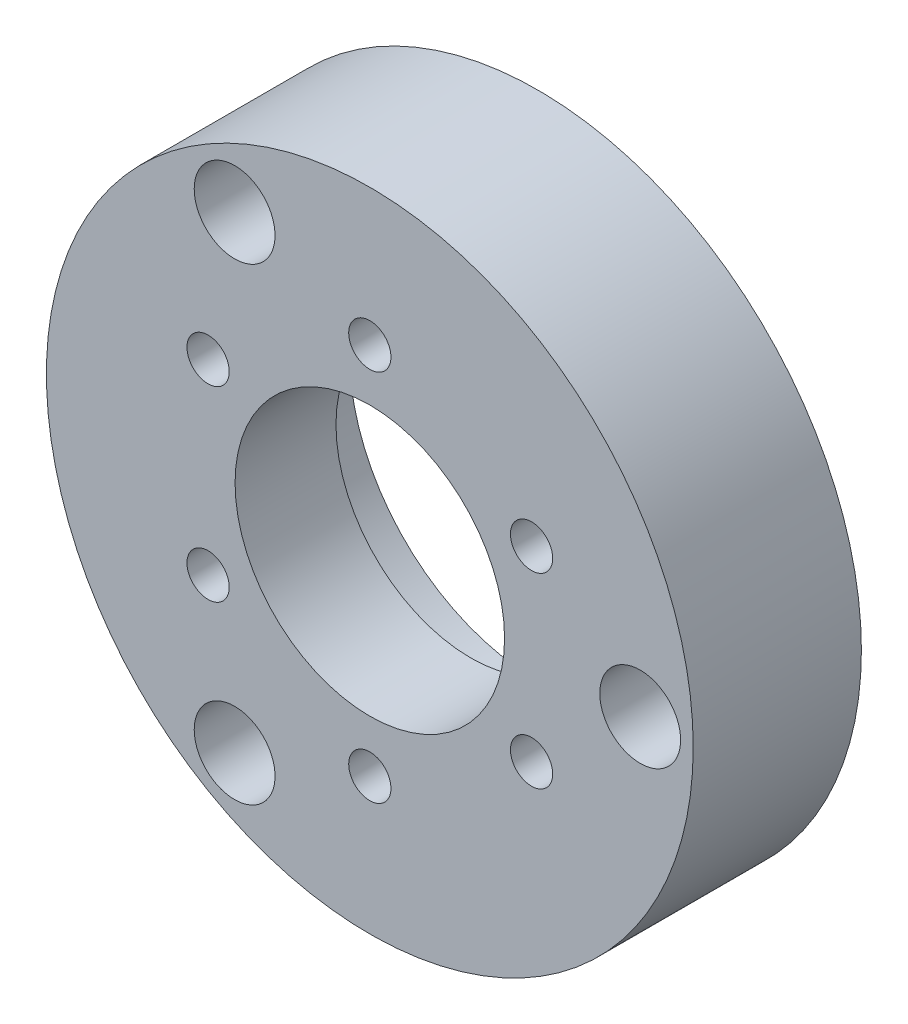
ISO-10303-21;
HEADER;
FILE_DESCRIPTION(('STEP AP214'),'2;1');
FILE_NAME('part.step','',(''),(''),'','','');
FILE_SCHEMA(('AUTOMOTIVE_DESIGN { 1 0 10303 214 1 1 1 1 }'));
ENDSEC;
DATA;
#1=APPLICATION_CONTEXT('core data for automotive mechanical design processes');
#2=APPLICATION_PROTOCOL_DEFINITION('international standard','automotive_design',2000,#1);
#3=PRODUCT_CONTEXT('',#1,'mechanical');
#4=PRODUCT('Part','Part','',(#3));
#5=PRODUCT_RELATED_PRODUCT_CATEGORY('part','',(#4));
#6=PRODUCT_DEFINITION_FORMATION('','',#4);
#7=PRODUCT_DEFINITION_CONTEXT('part definition',#1,'design');
#8=PRODUCT_DEFINITION('design','',#6,#7);
#9=PRODUCT_DEFINITION_SHAPE('','',#8);
#10=(LENGTH_UNIT() NAMED_UNIT(*) SI_UNIT(.MILLI.,.METRE.));
#11=(NAMED_UNIT(*) PLANE_ANGLE_UNIT() SI_UNIT($,.RADIAN.));
#12=(NAMED_UNIT(*) SI_UNIT($,.STERADIAN.) SOLID_ANGLE_UNIT());
#13=UNCERTAINTY_MEASURE_WITH_UNIT(LENGTH_MEASURE(1.E-05),#10,'distance_accuracy_value','');
#14=(GEOMETRIC_REPRESENTATION_CONTEXT(3) GLOBAL_UNCERTAINTY_ASSIGNED_CONTEXT((#13)) GLOBAL_UNIT_ASSIGNED_CONTEXT((#10,
#11,#12)) REPRESENTATION_CONTEXT('',''));
#15=CARTESIAN_POINT('',(0.,0.,0.));
#16=DIRECTION('',(0.,0.,1.));
#17=DIRECTION('',(1.,0.,0.));
#18=AXIS2_PLACEMENT_3D('',#15,#16,#17);
#19=CARTESIAN_POINT('',(0.,15.875,19.812));
#20=DIRECTION('',(0.,0.,-1.));
#21=DIRECTION('',(-1.,0.,0.));
#22=AXIS2_PLACEMENT_3D('',#19,#20,#21);
#23=PLANE('',#22);
#24=CARTESIAN_POINT('',(-15.9257999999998,-27.5842947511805,19.812));
#25=DIRECTION('',(0.,0.,-1.));
#26=DIRECTION('',(-1.,0.,0.));
#27=AXIS2_PLACEMENT_3D('',#24,#25,#26);
#28=CIRCLE('',#27,4.7625);
#29=CARTESIAN_POINT('',(-20.6882999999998,-27.5842947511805,19.812));
#30=VERTEX_POINT('',#29);
#31=EDGE_CURVE('E248',#30,#30,#28,.F.);
#32=ORIENTED_EDGE('',*,*,#31,.F.);
#33=EDGE_LOOP('',(#32));
#34=FACE_BOUND('',#33,.T.);
#35=CARTESIAN_POINT('',(19.0525588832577,-10.9999999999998,19.812));
#36=DIRECTION('',(0.,0.,-1.));
#37=DIRECTION('',(-1.,0.,0.));
#38=AXIS2_PLACEMENT_3D('',#35,#36,#37);
#39=CIRCLE('',#38,2.4892);
#40=CARTESIAN_POINT('',(16.5633588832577,-10.9999999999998,19.812));
#41=VERTEX_POINT('',#40);
#42=EDGE_CURVE('E149',#41,#41,#39,.F.);
#43=ORIENTED_EDGE('',*,*,#42,.F.);
#44=EDGE_LOOP('',(#43));
#45=FACE_BOUND('',#44,.T.);
#46=CARTESIAN_POINT('',(-19.0525588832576,-11.0000000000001,19.812));
#47=DIRECTION('',(0.,0.,-1.));
#48=DIRECTION('',(-1.,0.,0.));
#49=AXIS2_PLACEMENT_3D('',#46,#47,#48);
#50=CIRCLE('',#49,2.4892);
#51=CARTESIAN_POINT('',(-21.5417588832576,-11.0000000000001,19.812));
#52=VERTEX_POINT('',#51);
#53=EDGE_CURVE('E168',#52,#52,#50,.F.);
#54=ORIENTED_EDGE('',*,*,#53,.F.);
#55=EDGE_LOOP('',(#54));
#56=FACE_BOUND('',#55,.T.);
#57=CARTESIAN_POINT('',(0.,22.,19.812));
#58=DIRECTION('',(0.,0.,-1.));
#59=DIRECTION('',(-1.,0.,0.));
#60=AXIS2_PLACEMENT_3D('',#57,#58,#59);
#61=CIRCLE('',#60,2.4892);
#62=CARTESIAN_POINT('',(-2.4892,22.,19.812));
#63=VERTEX_POINT('',#62);
#64=EDGE_CURVE('E188',#63,#63,#61,.F.);
#65=ORIENTED_EDGE('',*,*,#64,.F.);
#66=EDGE_LOOP('',(#65));
#67=FACE_BOUND('',#66,.T.);
#68=CARTESIAN_POINT('',(0.,0.,19.812));
#69=DIRECTION('',(0.,0.,1.));
#70=DIRECTION('',(1.,0.,0.));
#71=AXIS2_PLACEMENT_3D('',#68,#69,#70);
#72=CIRCLE('',#71,15.875);
#73=CARTESIAN_POINT('',(15.875,0.,19.812));
#74=VERTEX_POINT('',#73);
#75=EDGE_CURVE('E202',#74,#74,#72,.T.);
#76=ORIENTED_EDGE('',*,*,#75,.F.);
#77=EDGE_LOOP('',(#76));
#78=FACE_BOUND('',#77,.T.);
#79=CARTESIAN_POINT('',(0.,0.,19.812));
#80=DIRECTION('',(0.,0.,1.));
#81=DIRECTION('',(1.,0.,0.));
#82=AXIS2_PLACEMENT_3D('',#79,#80,#81);
#83=CIRCLE('',#82,38.1);
#84=CARTESIAN_POINT('',(38.1,0.,19.812));
#85=VERTEX_POINT('',#84);
#86=EDGE_CURVE('E199',#85,#85,#83,.T.);
#87=ORIENTED_EDGE('',*,*,#86,.T.);
#88=EDGE_LOOP('',(#87));
#89=FACE_BOUND('',#88,.T.);
#90=CARTESIAN_POINT('',(-19.0525588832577,11.,19.812));
#91=DIRECTION('',(0.,0.,-1.));
#92=DIRECTION('',(-1.,0.,0.));
#93=AXIS2_PLACEMENT_3D('',#90,#91,#92);
#94=CIRCLE('',#93,2.4892);
#95=CARTESIAN_POINT('',(-21.5417588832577,11.,19.812));
#96=VERTEX_POINT('',#95);
#97=EDGE_CURVE('E178',#96,#96,#94,.F.);
#98=ORIENTED_EDGE('',*,*,#97,.F.);
#99=EDGE_LOOP('',(#98));
#100=FACE_BOUND('',#99,.T.);
#101=CARTESIAN_POINT('',(0.,-22.,19.812));
#102=DIRECTION('',(0.,0.,-1.));
#103=DIRECTION('',(-1.,0.,0.));
#104=AXIS2_PLACEMENT_3D('',#101,#102,#103);
#105=CIRCLE('',#104,2.4892);
#106=CARTESIAN_POINT('',(-2.4892,-22.,19.812));
#107=VERTEX_POINT('',#106);
#108=EDGE_CURVE('E158',#107,#107,#105,.F.);
#109=ORIENTED_EDGE('',*,*,#108,.F.);
#110=EDGE_LOOP('',(#109));
#111=FACE_BOUND('',#110,.T.);
#112=CARTESIAN_POINT('',(19.0525588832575,11.0000000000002,19.812));
#113=DIRECTION('',(0.,0.,-1.));
#114=DIRECTION('',(-1.,0.,0.));
#115=AXIS2_PLACEMENT_3D('',#112,#113,#114);
#116=CIRCLE('',#115,2.4892);
#117=CARTESIAN_POINT('',(16.5633588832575,11.0000000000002,19.812));
#118=VERTEX_POINT('',#117);
#119=EDGE_CURVE('E133',#118,#118,#116,.F.);
#120=ORIENTED_EDGE('',*,*,#119,.F.);
#121=EDGE_LOOP('',(#120));
#122=FACE_BOUND('',#121,.T.);
#123=CARTESIAN_POINT('',(-15.9258,27.5842947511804,19.812));
#124=DIRECTION('',(0.,0.,-1.));
#125=DIRECTION('',(-1.,0.,0.));
#126=AXIS2_PLACEMENT_3D('',#123,#124,#125);
#127=CIRCLE('',#126,4.7625);
#128=CARTESIAN_POINT('',(-20.6883,27.5842947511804,19.812));
#129=VERTEX_POINT('',#128);
#130=EDGE_CURVE('E240',#129,#129,#127,.F.);
#131=ORIENTED_EDGE('',*,*,#130,.F.);
#132=EDGE_LOOP('',(#131));
#133=FACE_BOUND('',#132,.T.);
#134=CARTESIAN_POINT('',(31.8516,-1.00782782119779E-13,19.812));
#135=DIRECTION('',(0.,0.,-1.));
#136=DIRECTION('',(-1.,0.,0.));
#137=AXIS2_PLACEMENT_3D('',#134,#135,#136);
#138=CIRCLE('',#137,4.7625);
#139=CARTESIAN_POINT('',(27.0891,-1.00782782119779E-13,19.812));
#140=VERTEX_POINT('',#139);
#141=EDGE_CURVE('E39',#140,#140,#138,.F.);
#142=ORIENTED_EDGE('',*,*,#141,.F.);
#143=EDGE_LOOP('',(#142));
#144=FACE_BOUND('',#143,.T.);
#145=ADVANCED_FACE('F35',(#34,#45,#56,#67,#78,#89,#100,#111,#122,#133,#144),#23,.F.);
#146=CARTESIAN_POINT('',(31.8516,-1.00782782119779E-13,50.8));
#147=DIRECTION('',(0.,0.,-1.));
#148=DIRECTION('',(-1.,0.,0.));
#149=AXIS2_PLACEMENT_3D('',#146,#147,#148);
#150=CYLINDRICAL_SURFACE('',#149,3.175);
#151=CARTESIAN_POINT('',(31.8516,-1.00782782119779E-13,0.));
#152=DIRECTION('',(0.,0.,1.));
#153=DIRECTION('',(1.,0.,0.));
#154=AXIS2_PLACEMENT_3D('',#151,#152,#153);
#155=CIRCLE('',#154,3.175);
#156=CARTESIAN_POINT('',(35.0266,-1.00782782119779E-13,0.));
#157=VERTEX_POINT('',#156);
#158=EDGE_CURVE('E268',#157,#157,#155,.T.);
#159=ORIENTED_EDGE('',*,*,#158,.F.);
#160=EDGE_LOOP('',(#159));
#161=FACE_BOUND('',#160,.T.);
#162=CARTESIAN_POINT('',(31.8516,-1.00782782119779E-13,6.35));
#163=DIRECTION('',(0.,0.,1.));
#164=DIRECTION('',(1.,0.,0.));
#165=AXIS2_PLACEMENT_3D('',#162,#163,#164);
#166=CIRCLE('',#165,3.175);
#167=CARTESIAN_POINT('',(35.0266,-1.00782782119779E-13,6.35));
#168=VERTEX_POINT('',#167);
#169=EDGE_CURVE('E251',#168,#168,#166,.T.);
#170=ORIENTED_EDGE('',*,*,#169,.T.);
#171=EDGE_LOOP('',(#170));
#172=FACE_BOUND('',#171,.T.);
#173=ADVANCED_FACE('F280',(#161,#172),#150,.F.);
#174=CARTESIAN_POINT('',(-15.9257999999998,-27.5842947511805,50.8));
#175=DIRECTION('',(0.,0.,-1.));
#176=DIRECTION('',(-1.,0.,0.));
#177=AXIS2_PLACEMENT_3D('',#174,#175,#176);
#178=CYLINDRICAL_SURFACE('',#177,3.175);
#179=CARTESIAN_POINT('',(-15.9257999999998,-27.5842947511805,0.));
#180=DIRECTION('',(0.,0.,1.));
#181=DIRECTION('',(1.,0.,0.));
#182=AXIS2_PLACEMENT_3D('',#179,#180,#181);
#183=CIRCLE('',#182,3.175);
#184=CARTESIAN_POINT('',(-12.7507999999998,-27.5842947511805,0.));
#185=VERTEX_POINT('',#184);
#186=EDGE_CURVE('E134',#185,#185,#183,.T.);
#187=ORIENTED_EDGE('',*,*,#186,.F.);
#188=EDGE_LOOP('',(#187));
#189=FACE_BOUND('',#188,.T.);
#190=CARTESIAN_POINT('',(-15.9257999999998,-27.5842947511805,6.35));
#191=DIRECTION('',(0.,0.,1.));
#192=DIRECTION('',(1.,0.,0.));
#193=AXIS2_PLACEMENT_3D('',#190,#191,#192);
#194=CIRCLE('',#193,3.175);
#195=CARTESIAN_POINT('',(-12.7507999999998,-27.5842947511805,6.35));
#196=VERTEX_POINT('',#195);
#197=EDGE_CURVE('E245',#196,#196,#194,.T.);
#198=ORIENTED_EDGE('',*,*,#197,.T.);
#199=EDGE_LOOP('',(#198));
#200=FACE_BOUND('',#199,.T.);
#201=ADVANCED_FACE('F276',(#189,#200),#178,.F.);
#202=CARTESIAN_POINT('',(-15.9258,27.5842947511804,50.8));
#203=DIRECTION('',(0.,0.,-1.));
#204=DIRECTION('',(-1.,0.,0.));
#205=AXIS2_PLACEMENT_3D('',#202,#203,#204);
#206=CYLINDRICAL_SURFACE('',#205,3.175);
#207=CARTESIAN_POINT('',(-15.9258,27.5842947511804,0.));
#208=DIRECTION('',(0.,0.,1.));
#209=DIRECTION('',(1.,0.,0.));
#210=AXIS2_PLACEMENT_3D('',#207,#208,#209);
#211=CIRCLE('',#210,3.175);
#212=CARTESIAN_POINT('',(-12.7508,27.5842947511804,0.));
#213=VERTEX_POINT('',#212);
#214=EDGE_CURVE('E244',#213,#213,#211,.T.);
#215=ORIENTED_EDGE('',*,*,#214,.F.);
#216=EDGE_LOOP('',(#215));
#217=FACE_BOUND('',#216,.T.);
#218=CARTESIAN_POINT('',(-15.9258,27.5842947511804,6.35));
#219=DIRECTION('',(0.,0.,1.));
#220=DIRECTION('',(1.,0.,0.));
#221=AXIS2_PLACEMENT_3D('',#218,#219,#220);
#222=CIRCLE('',#221,3.175);
#223=CARTESIAN_POINT('',(-12.7508,27.5842947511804,6.35));
#224=VERTEX_POINT('',#223);
#225=EDGE_CURVE('E237',#224,#224,#222,.T.);
#226=ORIENTED_EDGE('',*,*,#225,.T.);
#227=EDGE_LOOP('',(#226));
#228=FACE_BOUND('',#227,.T.);
#229=ADVANCED_FACE('F279',(#217,#228),#206,.F.);
#230=CARTESIAN_POINT('',(0.,38.1,0.));
#231=DIRECTION('',(0.,0.,1.));
#232=DIRECTION('',(1.,0.,0.));
#233=AXIS2_PLACEMENT_3D('',#230,#231,#232);
#234=PLANE('',#233);
#235=ORIENTED_EDGE('',*,*,#158,.T.);
#236=EDGE_LOOP('',(#235));
#237=FACE_BOUND('',#236,.T.);
#238=CARTESIAN_POINT('',(0.,0.,0.));
#239=DIRECTION('',(0.,0.,1.));
#240=DIRECTION('',(1.,0.,0.));
#241=AXIS2_PLACEMENT_3D('',#238,#239,#240);
#242=CIRCLE('',#241,22.1996);
#243=CARTESIAN_POINT('',(22.1996,0.,0.));
#244=VERTEX_POINT('',#243);
#245=EDGE_CURVE('E212',#244,#244,#242,.T.);
#246=ORIENTED_EDGE('',*,*,#245,.T.);
#247=EDGE_LOOP('',(#246));
#248=FACE_BOUND('',#247,.T.);
#249=CARTESIAN_POINT('',(0.,0.,0.));
#250=DIRECTION('',(0.,0.,1.));
#251=DIRECTION('',(1.,0.,0.));
#252=AXIS2_PLACEMENT_3D('',#249,#250,#251);
#253=CIRCLE('',#252,38.1);
#254=CARTESIAN_POINT('',(38.1,0.,0.));
#255=VERTEX_POINT('',#254);
#256=EDGE_CURVE('E196',#255,#255,#253,.T.);
#257=ORIENTED_EDGE('',*,*,#256,.F.);
#258=EDGE_LOOP('',(#257));
#259=FACE_BOUND('',#258,.T.);
#260=ORIENTED_EDGE('',*,*,#186,.T.);
#261=EDGE_LOOP('',(#260));
#262=FACE_BOUND('',#261,.T.);
#263=ORIENTED_EDGE('',*,*,#214,.T.);
#264=EDGE_LOOP('',(#263));
#265=FACE_BOUND('',#264,.T.);
#266=ADVANCED_FACE('F37',(#237,#248,#259,#262,#265),#234,.F.);
#267=CARTESIAN_POINT('',(0.,0.,0.));
#268=DIRECTION('',(0.,0.,1.));
#269=DIRECTION('',(1.,0.,0.));
#270=AXIS2_PLACEMENT_3D('',#267,#268,#269);
#271=CYLINDRICAL_SURFACE('',#270,22.1996);
#272=ORIENTED_EDGE('',*,*,#245,.F.);
#273=EDGE_LOOP('',(#272));
#274=FACE_BOUND('',#273,.T.);
#275=DIRECTION('',(0.,0.,-1.));
#276=VECTOR('',#275,1.);
#277=CARTESIAN_POINT('',(17.8600051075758,13.184932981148,19.05));
#278=LINE('',#277,#276);
#279=CARTESIAN_POINT('',(17.8600051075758,13.184932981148,7.9248));
#280=VERTEX_POINT('',#279);
#281=CARTESIAN_POINT('',(17.8600051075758,13.184932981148,6.35));
#282=VERTEX_POINT('',#281);
#283=EDGE_CURVE('E132',#280,#282,#278,.T.);
#284=ORIENTED_EDGE('',*,*,#283,.F.);
#285=CARTESIAN_POINT('',(0.,0.,7.9248));
#286=DIRECTION('',(0.,0.,1.));
#287=DIRECTION('',(1.,0.,0.));
#288=AXIS2_PLACEMENT_3D('',#285,#286,#287);
#289=CIRCLE('',#288,22.1996);
#290=CARTESIAN_POINT('',(2.4884843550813,22.0596846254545,7.9248));
#291=VERTEX_POINT('',#290);
#292=EDGE_CURVE('E208',#280,#291,#289,.T.);
#293=ORIENTED_EDGE('',*,*,#292,.T.);
#294=DIRECTION('',(0.,0.,-1.));
#295=VECTOR('',#294,1.);
#296=CARTESIAN_POINT('',(2.48848435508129,22.0596846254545,19.05));
#297=LINE('',#296,#295);
#298=CARTESIAN_POINT('',(2.48848435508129,22.0596846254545,6.35));
#299=VERTEX_POINT('',#298);
#300=EDGE_CURVE('E191',#299,#291,#297,.F.);
#301=ORIENTED_EDGE('',*,*,#300,.F.);
#302=CARTESIAN_POINT('',(0.,0.,6.35));
#303=DIRECTION('',(0.,0.,1.));
#304=DIRECTION('',(1.,0.,0.));
#305=AXIS2_PLACEMENT_3D('',#302,#303,#304);
#306=CIRCLE('',#305,22.1996);
#307=CARTESIAN_POINT('',(-2.48848435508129,22.0596846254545,6.35));
#308=VERTEX_POINT('',#307);
#309=EDGE_CURVE('E216',#308,#299,#306,.F.);
#310=ORIENTED_EDGE('',*,*,#309,.F.);
#311=DIRECTION('',(0.,0.,-1.));
#312=VECTOR('',#311,1.);
#313=CARTESIAN_POINT('',(-2.48848435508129,22.0596846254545,19.05));
#314=LINE('',#313,#312);
#315=CARTESIAN_POINT('',(-2.4884843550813,22.0596846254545,7.9248));
#316=VERTEX_POINT('',#315);
#317=EDGE_CURVE('E194',#316,#308,#314,.T.);
#318=ORIENTED_EDGE('',*,*,#317,.F.);
#319=CARTESIAN_POINT('',(-17.860005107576,13.1849329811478,7.9248));
#320=VERTEX_POINT('',#319);
#321=EDGE_CURVE('E209',#316,#320,#289,.T.);
#322=ORIENTED_EDGE('',*,*,#321,.T.);
#323=DIRECTION('',(0.,0.,-1.));
#324=VECTOR('',#323,1.);
#325=CARTESIAN_POINT('',(-17.860005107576,13.1849329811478,19.05));
#326=LINE('',#325,#324);
#327=CARTESIAN_POINT('',(-17.860005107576,13.1849329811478,6.35));
#328=VERTEX_POINT('',#327);
#329=EDGE_CURVE('E181',#328,#320,#326,.F.);
#330=ORIENTED_EDGE('',*,*,#329,.F.);
#331=CARTESIAN_POINT('',(0.,0.,6.35));
#332=DIRECTION('',(0.,0.,1.));
#333=DIRECTION('',(1.,0.,0.));
#334=AXIS2_PLACEMENT_3D('',#331,#332,#333);
#335=CIRCLE('',#334,22.1996);
#336=CARTESIAN_POINT('',(-20.3484894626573,8.87475164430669,6.35));
#337=VERTEX_POINT('',#336);
#338=EDGE_CURVE('E220',#337,#328,#335,.F.);
#339=ORIENTED_EDGE('',*,*,#338,.F.);
#340=DIRECTION('',(0.,0.,-1.));
#341=VECTOR('',#340,1.);
#342=CARTESIAN_POINT('',(-20.3484894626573,8.87475164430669,19.05));
#343=LINE('',#342,#341);
#344=CARTESIAN_POINT('',(-20.3484894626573,8.87475164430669,7.9248));
#345=VERTEX_POINT('',#344);
#346=EDGE_CURVE('E183',#345,#337,#343,.T.);
#347=ORIENTED_EDGE('',*,*,#346,.F.);
#348=CARTESIAN_POINT('',(-20.3484894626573,-8.87475164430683,7.9248));
#349=VERTEX_POINT('',#348);
#350=EDGE_CURVE('E213',#345,#349,#289,.T.);
#351=ORIENTED_EDGE('',*,*,#350,.T.);
#352=DIRECTION('',(0.,0.,-1.));
#353=VECTOR('',#352,1.);
#354=CARTESIAN_POINT('',(-20.3484894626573,-8.87475164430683,19.05));
#355=LINE('',#354,#353);
#356=CARTESIAN_POINT('',(-20.3484894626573,-8.87475164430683,6.35));
#357=VERTEX_POINT('',#356);
#358=EDGE_CURVE('E171',#357,#349,#355,.F.);
#359=ORIENTED_EDGE('',*,*,#358,.F.);
#360=CARTESIAN_POINT('',(0.,0.,6.35));
#361=DIRECTION('',(0.,0.,1.));
#362=DIRECTION('',(1.,0.,0.));
#363=AXIS2_PLACEMENT_3D('',#360,#361,#362);
#364=CIRCLE('',#363,22.1996);
#365=CARTESIAN_POINT('',(-17.8600051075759,-13.1849329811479,6.35));
#366=VERTEX_POINT('',#365);
#367=EDGE_CURVE('E224',#366,#357,#364,.F.);
#368=ORIENTED_EDGE('',*,*,#367,.F.);
#369=DIRECTION('',(0.,0.,-1.));
#370=VECTOR('',#369,1.);
#371=CARTESIAN_POINT('',(-17.8600051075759,-13.1849329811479,19.05));
#372=LINE('',#371,#370);
#373=CARTESIAN_POINT('',(-17.8600051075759,-13.1849329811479,7.9248));
#374=VERTEX_POINT('',#373);
#375=EDGE_CURVE('E173',#374,#366,#372,.T.);
#376=ORIENTED_EDGE('',*,*,#375,.F.);
#377=CARTESIAN_POINT('',(-2.4884843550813,-22.0596846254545,7.9248));
#378=VERTEX_POINT('',#377);
#379=EDGE_CURVE('E591',#374,#378,#289,.T.);
#380=ORIENTED_EDGE('',*,*,#379,.T.);
#381=DIRECTION('',(0.,0.,-1.));
#382=VECTOR('',#381,1.);
#383=CARTESIAN_POINT('',(-2.48848435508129,-22.0596846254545,19.05));
#384=LINE('',#383,#382);
#385=CARTESIAN_POINT('',(-2.48848435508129,-22.0596846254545,6.35));
#386=VERTEX_POINT('',#385);
#387=EDGE_CURVE('E161',#386,#378,#384,.F.);
#388=ORIENTED_EDGE('',*,*,#387,.F.);
#389=CARTESIAN_POINT('',(0.,0.,6.35));
#390=DIRECTION('',(0.,0.,1.));
#391=DIRECTION('',(1.,0.,0.));
#392=AXIS2_PLACEMENT_3D('',#389,#390,#391);
#393=CIRCLE('',#392,22.1996);
#394=CARTESIAN_POINT('',(2.48848435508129,-22.0596846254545,6.35));
#395=VERTEX_POINT('',#394);
#396=EDGE_CURVE('E228',#395,#386,#393,.F.);
#397=ORIENTED_EDGE('',*,*,#396,.F.);
#398=DIRECTION('',(0.,0.,-1.));
#399=VECTOR('',#398,1.);
#400=CARTESIAN_POINT('',(2.48848435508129,-22.0596846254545,19.05));
#401=LINE('',#400,#399);
#402=CARTESIAN_POINT('',(2.4884843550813,-22.0596846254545,7.9248));
#403=VERTEX_POINT('',#402);
#404=EDGE_CURVE('E163',#403,#395,#401,.T.);
#405=ORIENTED_EDGE('',*,*,#404,.F.);
#406=CARTESIAN_POINT('',(17.8600051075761,-13.1849329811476,7.9248));
#407=VERTEX_POINT('',#406);
#408=EDGE_CURVE('E593',#403,#407,#289,.T.);
#409=ORIENTED_EDGE('',*,*,#408,.T.);
#410=DIRECTION('',(0.,0.,-1.));
#411=VECTOR('',#410,1.);
#412=CARTESIAN_POINT('',(17.8600051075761,-13.1849329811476,19.05));
#413=LINE('',#412,#411);
#414=CARTESIAN_POINT('',(17.8600051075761,-13.1849329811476,6.35));
#415=VERTEX_POINT('',#414);
#416=EDGE_CURVE('E60',#415,#407,#413,.F.);
#417=ORIENTED_EDGE('',*,*,#416,.F.);
#418=CARTESIAN_POINT('',(0.,0.,6.35));
#419=DIRECTION('',(0.,0.,1.));
#420=DIRECTION('',(1.,0.,0.));
#421=AXIS2_PLACEMENT_3D('',#418,#419,#420);
#422=CIRCLE('',#421,22.1996);
#423=CARTESIAN_POINT('',(20.3484894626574,-8.87475164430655,6.35));
#424=VERTEX_POINT('',#423);
#425=EDGE_CURVE('E44',#424,#415,#422,.F.);
#426=ORIENTED_EDGE('',*,*,#425,.F.);
#427=DIRECTION('',(0.,0.,-1.));
#428=VECTOR('',#427,1.);
#429=CARTESIAN_POINT('',(20.3484894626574,-8.87475164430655,19.05));
#430=LINE('',#429,#428);
#431=CARTESIAN_POINT('',(20.3484894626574,-8.87475164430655,7.9248));
#432=VERTEX_POINT('',#431);
#433=EDGE_CURVE('E153',#432,#424,#430,.T.);
#434=ORIENTED_EDGE('',*,*,#433,.F.);
#435=CARTESIAN_POINT('',(20.3484894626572,8.87475164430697,7.9248));
#436=VERTEX_POINT('',#435);
#437=EDGE_CURVE('E140',#432,#436,#289,.T.);
#438=ORIENTED_EDGE('',*,*,#437,.T.);
#439=DIRECTION('',(0.,0.,-1.));
#440=VECTOR('',#439,1.);
#441=CARTESIAN_POINT('',(20.3484894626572,8.87475164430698,19.05));
#442=LINE('',#441,#440);
#443=CARTESIAN_POINT('',(20.3484894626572,8.87475164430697,6.35));
#444=VERTEX_POINT('',#443);
#445=EDGE_CURVE('E52',#444,#436,#442,.F.);
#446=ORIENTED_EDGE('',*,*,#445,.F.);
#447=CARTESIAN_POINT('',(0.,0.,6.35));
#448=DIRECTION('',(0.,0.,1.));
#449=DIRECTION('',(1.,0.,0.));
#450=AXIS2_PLACEMENT_3D('',#447,#448,#449);
#451=CIRCLE('',#450,22.1996);
#452=EDGE_CURVE('E11',#282,#444,#451,.F.);
#453=ORIENTED_EDGE('',*,*,#452,.F.);
#454=EDGE_LOOP('',(#284,#293,#301,#310,#318,#322,#330,#339,#347,#351,#359,#368,#376,#380,#388,
#397,#405,#409,#417,#426,#434,#438,#446,#453));
#455=FACE_BOUND('',#454,.T.);
#456=ADVANCED_FACE('F137',(#274,#455),#271,.F.);
#457=CARTESIAN_POINT('',(0.,22.1996,7.9248));
#458=DIRECTION('',(0.,0.,1.));
#459=DIRECTION('',(1.,0.,0.));
#460=AXIS2_PLACEMENT_3D('',#457,#458,#459);
#461=PLANE('',#460);
#462=CARTESIAN_POINT('',(0.,0.,7.9248));
#463=DIRECTION('',(0.,0.,1.));
#464=DIRECTION('',(1.,0.,0.));
#465=AXIS2_PLACEMENT_3D('',#462,#463,#464);
#466=CIRCLE('',#465,15.875);
#467=CARTESIAN_POINT('',(15.875,0.,7.9248));
#468=VERTEX_POINT('',#467);
#469=EDGE_CURVE('E205',#468,#468,#466,.T.);
#470=ORIENTED_EDGE('',*,*,#469,.T.);
#471=EDGE_LOOP('',(#470));
#472=FACE_BOUND('',#471,.T.);
#473=CARTESIAN_POINT('',(19.0525588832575,11.0000000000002,7.9248));
#474=DIRECTION('',(0.,0.,1.));
#475=DIRECTION('',(1.,0.,0.));
#476=AXIS2_PLACEMENT_3D('',#473,#474,#475);
#477=CIRCLE('',#476,2.4892);
#478=EDGE_CURVE('E141',#436,#280,#477,.F.);
#479=ORIENTED_EDGE('',*,*,#478,.F.);
#480=ORIENTED_EDGE('',*,*,#437,.F.);
#481=CARTESIAN_POINT('',(19.0525588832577,-10.9999999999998,7.9248));
#482=DIRECTION('',(0.,0.,1.));
#483=DIRECTION('',(1.,0.,0.));
#484=AXIS2_PLACEMENT_3D('',#481,#482,#483);
#485=CIRCLE('',#484,2.4892);
#486=EDGE_CURVE('E150',#407,#432,#485,.F.);
#487=ORIENTED_EDGE('',*,*,#486,.F.);
#488=ORIENTED_EDGE('',*,*,#408,.F.);
#489=CARTESIAN_POINT('',(0.,-22.,7.9248));
#490=DIRECTION('',(0.,0.,1.));
#491=DIRECTION('',(1.,0.,0.));
#492=AXIS2_PLACEMENT_3D('',#489,#490,#491);
#493=CIRCLE('',#492,2.4892);
#494=EDGE_CURVE('E159',#378,#403,#493,.F.);
#495=ORIENTED_EDGE('',*,*,#494,.F.);
#496=ORIENTED_EDGE('',*,*,#379,.F.);
#497=CARTESIAN_POINT('',(-19.0525588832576,-11.0000000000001,7.9248));
#498=DIRECTION('',(0.,0.,1.));
#499=DIRECTION('',(1.,0.,0.));
#500=AXIS2_PLACEMENT_3D('',#497,#498,#499);
#501=CIRCLE('',#500,2.4892);
#502=EDGE_CURVE('E169',#349,#374,#501,.F.);
#503=ORIENTED_EDGE('',*,*,#502,.F.);
#504=ORIENTED_EDGE('',*,*,#350,.F.);
#505=CARTESIAN_POINT('',(-19.0525588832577,11.,7.9248));
#506=DIRECTION('',(0.,0.,1.));
#507=DIRECTION('',(1.,0.,0.));
#508=AXIS2_PLACEMENT_3D('',#505,#506,#507);
#509=CIRCLE('',#508,2.4892);
#510=EDGE_CURVE('E179',#320,#345,#509,.F.);
#511=ORIENTED_EDGE('',*,*,#510,.F.);
#512=ORIENTED_EDGE('',*,*,#321,.F.);
#513=CARTESIAN_POINT('',(0.,22.,7.9248));
#514=DIRECTION('',(0.,0.,1.));
#515=DIRECTION('',(1.,0.,0.));
#516=AXIS2_PLACEMENT_3D('',#513,#514,#515);
#517=CIRCLE('',#516,2.4892);
#518=EDGE_CURVE('E189',#291,#316,#517,.F.);
#519=ORIENTED_EDGE('',*,*,#518,.F.);
#520=ORIENTED_EDGE('',*,*,#292,.F.);
#521=EDGE_LOOP('',(#479,#480,#487,#488,#495,#496,#503,#504,#511,#512,#519,#520));
#522=FACE_BOUND('',#521,.T.);
#523=ADVANCED_FACE('F396',(#472,#522),#461,.F.);
#524=CARTESIAN_POINT('',(0.,0.,0.));
#525=DIRECTION('',(0.,0.,1.));
#526=DIRECTION('',(1.,0.,0.));
#527=AXIS2_PLACEMENT_3D('',#524,#525,#526);
#528=CYLINDRICAL_SURFACE('',#527,15.875);
#529=ORIENTED_EDGE('',*,*,#469,.F.);
#530=EDGE_LOOP('',(#529));
#531=FACE_BOUND('',#530,.T.);
#532=ORIENTED_EDGE('',*,*,#75,.T.);
#533=EDGE_LOOP('',(#532));
#534=FACE_BOUND('',#533,.T.);
#535=ADVANCED_FACE('F391',(#531,#534),#528,.F.);
#536=CARTESIAN_POINT('',(0.,0.,0.));
#537=DIRECTION('',(0.,0.,1.));
#538=DIRECTION('',(1.,0.,0.));
#539=AXIS2_PLACEMENT_3D('',#536,#537,#538);
#540=CYLINDRICAL_SURFACE('',#539,38.1);
#541=ORIENTED_EDGE('',*,*,#86,.F.);
#542=EDGE_LOOP('',(#541));
#543=FACE_BOUND('',#542,.T.);
#544=ORIENTED_EDGE('',*,*,#256,.T.);
#545=EDGE_LOOP('',(#544));
#546=FACE_BOUND('',#545,.T.);
#547=ADVANCED_FACE('F385',(#543,#546),#540,.T.);
#548=CARTESIAN_POINT('',(0.,22.,6.35));
#549=DIRECTION('',(0.,0.,1.));
#550=DIRECTION('',(1.,0.,0.));
#551=AXIS2_PLACEMENT_3D('',#548,#549,#550);
#552=PLANE('',#551);
#553=ORIENTED_EDGE('',*,*,#309,.T.);
#554=CARTESIAN_POINT('',(0.,22.,6.35));
#555=DIRECTION('',(0.,0.,1.));
#556=DIRECTION('',(1.,0.,0.));
#557=AXIS2_PLACEMENT_3D('',#554,#555,#556);
#558=CIRCLE('',#557,2.4892);
#559=EDGE_CURVE('E185',#299,#308,#558,.T.);
#560=ORIENTED_EDGE('',*,*,#559,.T.);
#561=EDGE_LOOP('',(#553,#560));
#562=FACE_BOUND('',#561,.T.);
#563=ADVANCED_FACE('F382',(#562),#552,.T.);
#564=CARTESIAN_POINT('',(0.,22.,31.75));
#565=DIRECTION('',(0.,0.,-1.));
#566=DIRECTION('',(-1.,0.,0.));
#567=AXIS2_PLACEMENT_3D('',#564,#565,#566);
#568=CYLINDRICAL_SURFACE('',#567,2.4892);
#569=ORIENTED_EDGE('',*,*,#64,.T.);
#570=EDGE_LOOP('',(#569));
#571=FACE_BOUND('',#570,.T.);
#572=ORIENTED_EDGE('',*,*,#317,.T.);
#573=ORIENTED_EDGE('',*,*,#559,.F.);
#574=ORIENTED_EDGE('',*,*,#300,.T.);
#575=ORIENTED_EDGE('',*,*,#518,.T.);
#576=EDGE_LOOP('',(#572,#573,#574,#575));
#577=FACE_BOUND('',#576,.T.);
#578=ADVANCED_FACE('F377',(#571,#577),#568,.F.);
#579=CARTESIAN_POINT('',(-19.0525588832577,11.,6.35));
#580=DIRECTION('',(0.,0.,1.));
#581=DIRECTION('',(0.499999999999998,0.86602540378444,0.));
#582=AXIS2_PLACEMENT_3D('',#579,#580,#581);
#583=PLANE('',#582);
#584=ORIENTED_EDGE('',*,*,#338,.T.);
#585=CARTESIAN_POINT('',(-19.0525588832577,11.,6.35));
#586=DIRECTION('',(0.,0.,1.));
#587=DIRECTION('',(0.499999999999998,0.86602540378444,0.));
#588=AXIS2_PLACEMENT_3D('',#585,#586,#587);
#589=CIRCLE('',#588,2.4892);
#590=EDGE_CURVE('E175',#328,#337,#589,.T.);
#591=ORIENTED_EDGE('',*,*,#590,.T.);
#592=EDGE_LOOP('',(#584,#591));
#593=FACE_BOUND('',#592,.T.);
#594=ADVANCED_FACE('F374',(#593),#583,.T.);
#595=CARTESIAN_POINT('',(-19.0525588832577,11.,31.75));
#596=DIRECTION('',(0.,0.,-1.));
#597=DIRECTION('',(-1.,0.,0.));
#598=AXIS2_PLACEMENT_3D('',#595,#596,#597);
#599=CYLINDRICAL_SURFACE('',#598,2.4892);
#600=ORIENTED_EDGE('',*,*,#97,.T.);
#601=EDGE_LOOP('',(#600));
#602=FACE_BOUND('',#601,.T.);
#603=ORIENTED_EDGE('',*,*,#346,.T.);
#604=ORIENTED_EDGE('',*,*,#590,.F.);
#605=ORIENTED_EDGE('',*,*,#329,.T.);
#606=ORIENTED_EDGE('',*,*,#510,.T.);
#607=EDGE_LOOP('',(#603,#604,#605,#606));
#608=FACE_BOUND('',#607,.T.);
#609=ADVANCED_FACE('F369',(#602,#608),#599,.F.);
#610=CARTESIAN_POINT('',(-19.0525588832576,-11.0000000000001,6.35));
#611=DIRECTION('',(0.,0.,1.));
#612=DIRECTION('',(-0.500000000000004,0.866025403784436,0.));
#613=AXIS2_PLACEMENT_3D('',#610,#611,#612);
#614=PLANE('',#613);
#615=ORIENTED_EDGE('',*,*,#367,.T.);
#616=CARTESIAN_POINT('',(-19.0525588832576,-11.0000000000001,6.35));
#617=DIRECTION('',(0.,0.,1.));
#618=DIRECTION('',(-0.500000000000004,0.866025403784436,0.));
#619=AXIS2_PLACEMENT_3D('',#616,#617,#618);
#620=CIRCLE('',#619,2.4892);
#621=EDGE_CURVE('E165',#357,#366,#620,.T.);
#622=ORIENTED_EDGE('',*,*,#621,.T.);
#623=EDGE_LOOP('',(#615,#622));
#624=FACE_BOUND('',#623,.T.);
#625=ADVANCED_FACE('F366',(#624),#614,.T.);
#626=CARTESIAN_POINT('',(-19.0525588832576,-11.0000000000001,31.75));
#627=DIRECTION('',(0.,0.,-1.));
#628=DIRECTION('',(-1.,0.,0.));
#629=AXIS2_PLACEMENT_3D('',#626,#627,#628);
#630=CYLINDRICAL_SURFACE('',#629,2.4892);
#631=ORIENTED_EDGE('',*,*,#53,.T.);
#632=EDGE_LOOP('',(#631));
#633=FACE_BOUND('',#632,.T.);
#634=ORIENTED_EDGE('',*,*,#375,.T.);
#635=ORIENTED_EDGE('',*,*,#621,.F.);
#636=ORIENTED_EDGE('',*,*,#358,.T.);
#637=ORIENTED_EDGE('',*,*,#502,.T.);
#638=EDGE_LOOP('',(#634,#635,#636,#637));
#639=FACE_BOUND('',#638,.T.);
#640=ADVANCED_FACE('F361',(#633,#639),#630,.F.);
#641=CARTESIAN_POINT('',(0.,-22.,6.35));
#642=DIRECTION('',(0.,0.,1.));
#643=DIRECTION('',(-1.,0.,0.));
#644=AXIS2_PLACEMENT_3D('',#641,#642,#643);
#645=PLANE('',#644);
#646=ORIENTED_EDGE('',*,*,#396,.T.);
#647=CARTESIAN_POINT('',(0.,-22.,6.35));
#648=DIRECTION('',(0.,0.,1.));
#649=DIRECTION('',(-1.,0.,0.));
#650=AXIS2_PLACEMENT_3D('',#647,#648,#649);
#651=CIRCLE('',#650,2.4892);
#652=EDGE_CURVE('E155',#386,#395,#651,.T.);
#653=ORIENTED_EDGE('',*,*,#652,.T.);
#654=EDGE_LOOP('',(#646,#653));
#655=FACE_BOUND('',#654,.T.);
#656=ADVANCED_FACE('F358',(#655),#645,.T.);
#657=CARTESIAN_POINT('',(0.,-22.,31.75));
#658=DIRECTION('',(0.,0.,-1.));
#659=DIRECTION('',(-1.,0.,0.));
#660=AXIS2_PLACEMENT_3D('',#657,#658,#659);
#661=CYLINDRICAL_SURFACE('',#660,2.4892);
#662=ORIENTED_EDGE('',*,*,#108,.T.);
#663=EDGE_LOOP('',(#662));
#664=FACE_BOUND('',#663,.T.);
#665=ORIENTED_EDGE('',*,*,#404,.T.);
#666=ORIENTED_EDGE('',*,*,#652,.F.);
#667=ORIENTED_EDGE('',*,*,#387,.T.);
#668=ORIENTED_EDGE('',*,*,#494,.T.);
#669=EDGE_LOOP('',(#665,#666,#667,#668));
#670=FACE_BOUND('',#669,.T.);
#671=ADVANCED_FACE('F353',(#664,#670),#661,.F.);
#672=CARTESIAN_POINT('',(19.0525588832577,-10.9999999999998,6.35));
#673=DIRECTION('',(0.,0.,1.));
#674=DIRECTION('',(-0.499999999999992,-0.866025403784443,0.));
#675=AXIS2_PLACEMENT_3D('',#672,#673,#674);
#676=PLANE('',#675);
#677=ORIENTED_EDGE('',*,*,#425,.T.);
#678=CARTESIAN_POINT('',(19.0525588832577,-10.9999999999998,6.35));
#679=DIRECTION('',(0.,0.,1.));
#680=DIRECTION('',(-0.499999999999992,-0.866025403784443,0.));
#681=AXIS2_PLACEMENT_3D('',#678,#679,#680);
#682=CIRCLE('',#681,2.4892);
#683=EDGE_CURVE('E143',#415,#424,#682,.T.);
#684=ORIENTED_EDGE('',*,*,#683,.T.);
#685=EDGE_LOOP('',(#677,#684));
#686=FACE_BOUND('',#685,.T.);
#687=ADVANCED_FACE('F350',(#686),#676,.T.);
#688=CARTESIAN_POINT('',(19.0525588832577,-10.9999999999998,31.75));
#689=DIRECTION('',(0.,0.,-1.));
#690=DIRECTION('',(-1.,0.,0.));
#691=AXIS2_PLACEMENT_3D('',#688,#689,#690);
#692=CYLINDRICAL_SURFACE('',#691,2.4892);
#693=ORIENTED_EDGE('',*,*,#42,.T.);
#694=EDGE_LOOP('',(#693));
#695=FACE_BOUND('',#694,.T.);
#696=ORIENTED_EDGE('',*,*,#433,.T.);
#697=ORIENTED_EDGE('',*,*,#683,.F.);
#698=ORIENTED_EDGE('',*,*,#416,.T.);
#699=ORIENTED_EDGE('',*,*,#486,.T.);
#700=EDGE_LOOP('',(#696,#697,#698,#699));
#701=FACE_BOUND('',#700,.T.);
#702=ADVANCED_FACE('F346',(#695,#701),#692,.F.);
#703=CARTESIAN_POINT('',(19.0525588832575,11.0000000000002,6.35));
#704=DIRECTION('',(0.,0.,1.));
#705=DIRECTION('',(0.50000000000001,-0.866025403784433,0.));
#706=AXIS2_PLACEMENT_3D('',#703,#704,#705);
#707=PLANE('',#706);
#708=ORIENTED_EDGE('',*,*,#452,.T.);
#709=CARTESIAN_POINT('',(19.0525588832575,11.0000000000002,6.35));
#710=DIRECTION('',(0.,0.,1.));
#711=DIRECTION('',(0.50000000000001,-0.866025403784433,0.));
#712=AXIS2_PLACEMENT_3D('',#709,#710,#711);
#713=CIRCLE('',#712,2.4892);
#714=EDGE_CURVE('E128',#444,#282,#713,.T.);
#715=ORIENTED_EDGE('',*,*,#714,.T.);
#716=EDGE_LOOP('',(#708,#715));
#717=FACE_BOUND('',#716,.T.);
#718=ADVANCED_FACE('F127',(#717),#707,.T.);
#719=CARTESIAN_POINT('',(19.0525588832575,11.0000000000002,31.75));
#720=DIRECTION('',(0.,0.,-1.));
#721=DIRECTION('',(-1.,0.,0.));
#722=AXIS2_PLACEMENT_3D('',#719,#720,#721);
#723=CYLINDRICAL_SURFACE('',#722,2.4892);
#724=ORIENTED_EDGE('',*,*,#119,.T.);
#725=EDGE_LOOP('',(#724));
#726=FACE_BOUND('',#725,.T.);
#727=ORIENTED_EDGE('',*,*,#283,.T.);
#728=ORIENTED_EDGE('',*,*,#714,.F.);
#729=ORIENTED_EDGE('',*,*,#445,.T.);
#730=ORIENTED_EDGE('',*,*,#478,.T.);
#731=EDGE_LOOP('',(#727,#728,#729,#730));
#732=FACE_BOUND('',#731,.T.);
#733=ADVANCED_FACE('F131',(#726,#732),#723,.F.);
#734=CARTESIAN_POINT('',(-15.9258,27.5842947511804,57.15));
#735=DIRECTION('',(0.,0.,-1.));
#736=DIRECTION('',(-1.,0.,0.));
#737=AXIS2_PLACEMENT_3D('',#734,#735,#736);
#738=CYLINDRICAL_SURFACE('',#737,4.7625);
#739=CARTESIAN_POINT('',(-15.9258,27.5842947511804,6.35));
#740=DIRECTION('',(0.,0.,1.));
#741=DIRECTION('',(1.,0.,0.));
#742=AXIS2_PLACEMENT_3D('',#739,#740,#741);
#743=CIRCLE('',#742,4.7625);
#744=CARTESIAN_POINT('',(-11.1633,27.5842947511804,6.35));
#745=VERTEX_POINT('',#744);
#746=EDGE_CURVE('E241',#745,#745,#743,.T.);
#747=ORIENTED_EDGE('',*,*,#746,.F.);
#748=EDGE_LOOP('',(#747));
#749=FACE_BOUND('',#748,.T.);
#750=ORIENTED_EDGE('',*,*,#130,.T.);
#751=EDGE_LOOP('',(#750));
#752=FACE_BOUND('',#751,.T.);
#753=ADVANCED_FACE('F333',(#749,#752),#738,.F.);
#754=CARTESIAN_POINT('',(-15.9258,27.5842947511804,6.35));
#755=DIRECTION('',(0.,0.,1.));
#756=DIRECTION('',(1.,0.,0.));
#757=AXIS2_PLACEMENT_3D('',#754,#755,#756);
#758=PLANE('',#757);
#759=ORIENTED_EDGE('',*,*,#225,.F.);
#760=EDGE_LOOP('',(#759));
#761=FACE_BOUND('',#760,.T.);
#762=ORIENTED_EDGE('',*,*,#746,.T.);
#763=EDGE_LOOP('',(#762));
#764=FACE_BOUND('',#763,.T.);
#765=ADVANCED_FACE('F294',(#761,#764),#758,.T.);
#766=CARTESIAN_POINT('',(-15.9257999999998,-27.5842947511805,57.15));
#767=DIRECTION('',(0.,0.,-1.));
#768=DIRECTION('',(-1.,0.,0.));
#769=AXIS2_PLACEMENT_3D('',#766,#767,#768);
#770=CYLINDRICAL_SURFACE('',#769,4.7625);
#771=CARTESIAN_POINT('',(-15.9257999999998,-27.5842947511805,6.35));
#772=DIRECTION('',(0.,0.,1.));
#773=DIRECTION('',(1.,0.,0.));
#774=AXIS2_PLACEMENT_3D('',#771,#772,#773);
#775=CIRCLE('',#774,4.7625);
#776=CARTESIAN_POINT('',(-11.1632999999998,-27.5842947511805,6.35));
#777=VERTEX_POINT('',#776);
#778=EDGE_CURVE('E249',#777,#777,#775,.T.);
#779=ORIENTED_EDGE('',*,*,#778,.F.);
#780=EDGE_LOOP('',(#779));
#781=FACE_BOUND('',#780,.T.);
#782=ORIENTED_EDGE('',*,*,#31,.T.);
#783=EDGE_LOOP('',(#782));
#784=FACE_BOUND('',#783,.T.);
#785=ADVANCED_FACE('F288',(#781,#784),#770,.F.);
#786=CARTESIAN_POINT('',(-15.9257999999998,-27.5842947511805,6.35));
#787=DIRECTION('',(0.,0.,1.));
#788=DIRECTION('',(1.,0.,0.));
#789=AXIS2_PLACEMENT_3D('',#786,#787,#788);
#790=PLANE('',#789);
#791=ORIENTED_EDGE('',*,*,#197,.F.);
#792=EDGE_LOOP('',(#791));
#793=FACE_BOUND('',#792,.T.);
#794=ORIENTED_EDGE('',*,*,#778,.T.);
#795=EDGE_LOOP('',(#794));
#796=FACE_BOUND('',#795,.T.);
#797=ADVANCED_FACE('F284',(#793,#796),#790,.T.);
#798=CARTESIAN_POINT('',(31.8516,-1.00782782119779E-13,57.15));
#799=DIRECTION('',(0.,0.,-1.));
#800=DIRECTION('',(-1.,0.,0.));
#801=AXIS2_PLACEMENT_3D('',#798,#799,#800);
#802=CYLINDRICAL_SURFACE('',#801,4.7625);
#803=CARTESIAN_POINT('',(31.8516,-1.00782782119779E-13,6.35));
#804=DIRECTION('',(0.,0.,1.));
#805=DIRECTION('',(1.,0.,0.));
#806=AXIS2_PLACEMENT_3D('',#803,#804,#805);
#807=CIRCLE('',#806,4.7625);
#808=CARTESIAN_POINT('',(36.6141,-1.00782782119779E-13,6.35));
#809=VERTEX_POINT('',#808);
#810=EDGE_CURVE('E253',#809,#809,#807,.T.);
#811=ORIENTED_EDGE('',*,*,#810,.F.);
#812=EDGE_LOOP('',(#811));
#813=FACE_BOUND('',#812,.T.);
#814=ORIENTED_EDGE('',*,*,#141,.T.);
#815=EDGE_LOOP('',(#814));
#816=FACE_BOUND('',#815,.T.);
#817=ADVANCED_FACE('F287',(#813,#816),#802,.F.);
#818=CARTESIAN_POINT('',(31.8516,-1.00782782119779E-13,6.35));
#819=DIRECTION('',(0.,0.,1.));
#820=DIRECTION('',(1.,0.,0.));
#821=AXIS2_PLACEMENT_3D('',#818,#819,#820);
#822=PLANE('',#821);
#823=ORIENTED_EDGE('',*,*,#169,.F.);
#824=EDGE_LOOP('',(#823));
#825=FACE_BOUND('',#824,.T.);
#826=ORIENTED_EDGE('',*,*,#810,.T.);
#827=EDGE_LOOP('',(#826));
#828=FACE_BOUND('',#827,.T.);
#829=ADVANCED_FACE('F322',(#825,#828),#822,.T.);
#830=CLOSED_SHELL('',(#145,#173,#201,#229,#266,#456,#523,#535,#547,#563,#578,#594,#609,#625,
#640,#656,#671,#687,#702,#718,#733,#753,#765,#785,#797,#817,#829));
#831=MANIFOLD_SOLID_BREP('B2',#830);
#832=ADVANCED_BREP_SHAPE_REPRESENTATION('',(#18,#831),#14);
#833=SHAPE_DEFINITION_REPRESENTATION(#9,#832);
ENDSEC;
END-ISO-10303-21;
